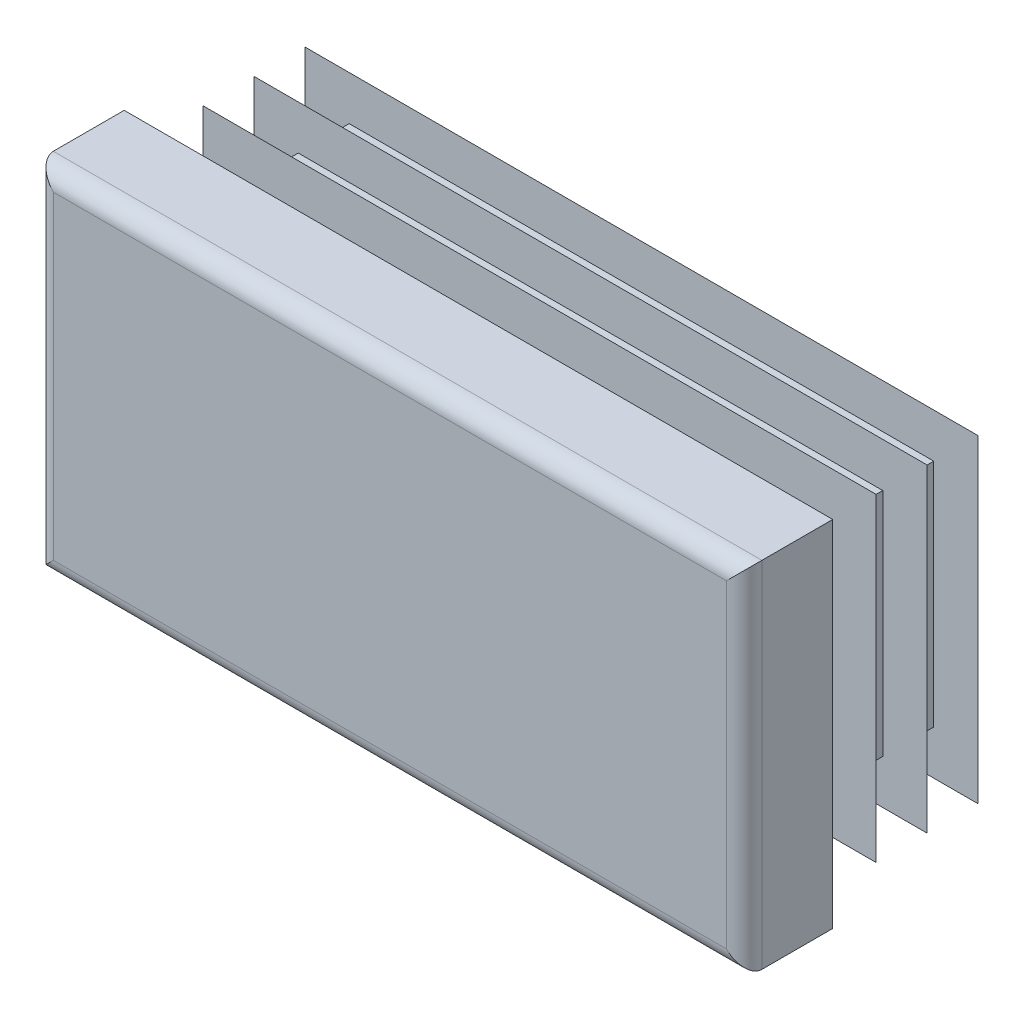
ISO-10303-21;
HEADER;
FILE_DESCRIPTION(('STEP AP214'),'2;1');
FILE_NAME('part.step','',(''),(''),'','','');
FILE_SCHEMA(('AUTOMOTIVE_DESIGN { 1 0 10303 214 1 1 1 1 }'));
ENDSEC;
DATA;
#1=APPLICATION_CONTEXT('core data for automotive mechanical design processes');
#2=APPLICATION_PROTOCOL_DEFINITION('international standard','automotive_design',2000,#1);
#3=PRODUCT_CONTEXT('',#1,'mechanical');
#4=PRODUCT('Part','Part','',(#3));
#5=PRODUCT_RELATED_PRODUCT_CATEGORY('part','',(#4));
#6=PRODUCT_DEFINITION_FORMATION('','',#4);
#7=PRODUCT_DEFINITION_CONTEXT('part definition',#1,'design');
#8=PRODUCT_DEFINITION('design','',#6,#7);
#9=PRODUCT_DEFINITION_SHAPE('','',#8);
#10=(LENGTH_UNIT() NAMED_UNIT(*) SI_UNIT(.MILLI.,.METRE.));
#11=(NAMED_UNIT(*) PLANE_ANGLE_UNIT() SI_UNIT($,.RADIAN.));
#12=(NAMED_UNIT(*) SI_UNIT($,.STERADIAN.) SOLID_ANGLE_UNIT());
#13=UNCERTAINTY_MEASURE_WITH_UNIT(LENGTH_MEASURE(1.E-05),#10,'distance_accuracy_value','');
#14=(GEOMETRIC_REPRESENTATION_CONTEXT(3) GLOBAL_UNCERTAINTY_ASSIGNED_CONTEXT((#13)) GLOBAL_UNIT_ASSIGNED_CONTEXT((#10,
#11,#12)) REPRESENTATION_CONTEXT('',''));
#15=CARTESIAN_POINT('',(0.,0.,0.));
#16=DIRECTION('',(0.,0.,1.));
#17=DIRECTION('',(1.,0.,0.));
#18=AXIS2_PLACEMENT_3D('',#15,#16,#17);
#19=CARTESIAN_POINT('',(19.,-10.,5.));
#20=DIRECTION('',(0.,0.,-1.));
#21=DIRECTION('',(0.,1.,0.));
#22=AXIS2_PLACEMENT_3D('',#19,#20,#21);
#23=PLANE('',#22);
#24=DIRECTION('',(0.,1.,0.));
#25=VECTOR('',#24,1.);
#26=CARTESIAN_POINT('',(-19.,-10.,5.));
#27=LINE('',#26,#25);
#28=CARTESIAN_POINT('',(-19.,-9.,5.));
#29=VERTEX_POINT('',#28);
#30=CARTESIAN_POINT('',(-19.,9.,5.));
#31=VERTEX_POINT('',#30);
#32=EDGE_CURVE('E310',#29,#31,#27,.T.);
#33=ORIENTED_EDGE('',*,*,#32,.F.);
#34=DIRECTION('',(-1.,0.,0.));
#35=VECTOR('',#34,1.);
#36=CARTESIAN_POINT('',(20.,-9.,5.));
#37=LINE('',#36,#35);
#38=CARTESIAN_POINT('',(19.,-9.,5.));
#39=VERTEX_POINT('',#38);
#40=EDGE_CURVE('E482',#39,#29,#37,.T.);
#41=ORIENTED_EDGE('',*,*,#40,.F.);
#42=DIRECTION('',(0.,1.,0.));
#43=VECTOR('',#42,1.);
#44=CARTESIAN_POINT('',(19.,-10.,5.));
#45=LINE('',#44,#43);
#46=CARTESIAN_POINT('',(19.,9.,5.));
#47=VERTEX_POINT('',#46);
#48=EDGE_CURVE('E305',#39,#47,#45,.T.);
#49=ORIENTED_EDGE('',*,*,#48,.T.);
#50=DIRECTION('',(-1.,0.,0.));
#51=VECTOR('',#50,1.);
#52=CARTESIAN_POINT('',(20.,9.,5.));
#53=LINE('',#52,#51);
#54=EDGE_CURVE('E630',#47,#31,#53,.T.);
#55=ORIENTED_EDGE('',*,*,#54,.T.);
#56=EDGE_LOOP('',(#33,#41,#49,#55));
#57=FACE_BOUND('',#56,.T.);
#58=ADVANCED_FACE('F14',(#57),#23,.F.);
#59=CARTESIAN_POINT('',(-19.,-10.,4.));
#60=DIRECTION('',(0.,1.,0.));
#61=DIRECTION('',(-1.,0.,0.));
#62=AXIS2_PLACEMENT_3D('',#59,#60,#61);
#63=CYLINDRICAL_SURFACE('',#62,1.);
#64=DIRECTION('',(0.,1.,0.));
#65=VECTOR('',#64,1.);
#66=CARTESIAN_POINT('',(-20.,-10.,4.));
#67=LINE('',#66,#65);
#68=CARTESIAN_POINT('',(-20.,-10.,4.));
#69=VERTEX_POINT('',#68);
#70=CARTESIAN_POINT('',(-20.,10.,4.));
#71=VERTEX_POINT('',#70);
#72=EDGE_CURVE('E402',#69,#71,#67,.T.);
#73=ORIENTED_EDGE('',*,*,#72,.F.);
#74=CARTESIAN_POINT('',(-19.,-9.,4.));
#75=DIRECTION('',(-0.707106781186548,0.707106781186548,0.));
#76=DIRECTION('',(0.707106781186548,0.707106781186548,0.));
#77=AXIS2_PLACEMENT_3D('',#74,#75,#76);
#78=ELLIPSE('',#77,1.41421356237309,1.);
#79=EDGE_CURVE('E59',#69,#29,#78,.T.);
#80=ORIENTED_EDGE('',*,*,#79,.T.);
#81=ORIENTED_EDGE('',*,*,#32,.T.);
#82=CARTESIAN_POINT('',(-19.,9.,4.));
#83=DIRECTION('',(0.707106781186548,0.707106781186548,0.));
#84=DIRECTION('',(-0.707106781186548,0.707106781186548,0.));
#85=AXIS2_PLACEMENT_3D('',#82,#83,#84);
#86=ELLIPSE('',#85,1.41421356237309,1.);
#87=EDGE_CURVE('E306',#31,#71,#86,.F.);
#88=ORIENTED_EDGE('',*,*,#87,.T.);
#89=EDGE_LOOP('',(#73,#80,#81,#88));
#90=FACE_BOUND('',#89,.T.);
#91=ADVANCED_FACE('F16',(#90),#63,.T.);
#92=CARTESIAN_POINT('',(-20.,-10.,4.));
#93=DIRECTION('',(1.,0.,0.));
#94=DIRECTION('',(0.,1.,0.));
#95=AXIS2_PLACEMENT_3D('',#92,#93,#94);
#96=PLANE('',#95);
#97=DIRECTION('',(0.,0.,-1.));
#98=VECTOR('',#97,1.);
#99=CARTESIAN_POINT('',(-20.,10.,4.));
#100=LINE('',#99,#98);
#101=CARTESIAN_POINT('',(-20.,10.,0.));
#102=VERTEX_POINT('',#101);
#103=EDGE_CURVE('E615',#71,#102,#100,.T.);
#104=ORIENTED_EDGE('',*,*,#103,.T.);
#105=DIRECTION('',(0.,1.,0.));
#106=VECTOR('',#105,1.);
#107=CARTESIAN_POINT('',(-20.,-10.,0.));
#108=LINE('',#107,#106);
#109=CARTESIAN_POINT('',(-20.,-10.,0.));
#110=VERTEX_POINT('',#109);
#111=EDGE_CURVE('E400',#110,#102,#108,.T.);
#112=ORIENTED_EDGE('',*,*,#111,.F.);
#113=DIRECTION('',(0.,0.,-1.));
#114=VECTOR('',#113,1.);
#115=CARTESIAN_POINT('',(-20.,-10.,4.));
#116=LINE('',#115,#114);
#117=EDGE_CURVE('E616',#69,#110,#116,.T.);
#118=ORIENTED_EDGE('',*,*,#117,.F.);
#119=ORIENTED_EDGE('',*,*,#72,.T.);
#120=EDGE_LOOP('',(#104,#112,#118,#119));
#121=FACE_BOUND('',#120,.T.);
#122=ADVANCED_FACE('F697',(#121),#96,.F.);
#123=CARTESIAN_POINT('',(-16.5,-10.,0.));
#124=DIRECTION('',(1.,0.,0.));
#125=DIRECTION('',(0.,1.,0.));
#126=AXIS2_PLACEMENT_3D('',#123,#124,#125);
#127=PLANE('',#126);
#128=DIRECTION('',(0.,1.,0.));
#129=VECTOR('',#128,1.);
#130=CARTESIAN_POINT('',(-16.5,-10.,0.));
#131=LINE('',#130,#129);
#132=CARTESIAN_POINT('',(-16.5,-6.5,0.));
#133=VERTEX_POINT('',#132);
#134=CARTESIAN_POINT('',(-16.5,6.5,0.));
#135=VERTEX_POINT('',#134);
#136=EDGE_CURVE('E397',#133,#135,#131,.T.);
#137=ORIENTED_EDGE('',*,*,#136,.T.);
#138=DIRECTION('',(0.,0.,-1.));
#139=VECTOR('',#138,1.);
#140=CARTESIAN_POINT('',(-16.5,6.5,0.));
#141=LINE('',#140,#139);
#142=CARTESIAN_POINT('',(-16.5,6.5,-0.575));
#143=VERTEX_POINT('',#142);
#144=EDGE_CURVE('E495',#135,#143,#141,.T.);
#145=ORIENTED_EDGE('',*,*,#144,.T.);
#146=DIRECTION('',(0.,1.,0.));
#147=VECTOR('',#146,1.);
#148=CARTESIAN_POINT('',(-16.5,-10.,-0.575));
#149=LINE('',#148,#147);
#150=CARTESIAN_POINT('',(-16.5,-6.5,-0.575));
#151=VERTEX_POINT('',#150);
#152=EDGE_CURVE('E394',#151,#143,#149,.T.);
#153=ORIENTED_EDGE('',*,*,#152,.F.);
#154=DIRECTION('',(0.,0.,1.));
#155=VECTOR('',#154,1.);
#156=CARTESIAN_POINT('',(-16.5,-6.5,0.));
#157=LINE('',#156,#155);
#158=EDGE_CURVE('E489',#151,#133,#157,.T.);
#159=ORIENTED_EDGE('',*,*,#158,.T.);
#160=EDGE_LOOP('',(#137,#145,#153,#159));
#161=FACE_BOUND('',#160,.T.);
#162=ADVANCED_FACE('F787',(#161),#127,.F.);
#163=CARTESIAN_POINT('',(-19.,-10.,-0.575));
#164=DIRECTION('',(0.342020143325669,0.,0.939692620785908));
#165=DIRECTION('',(-0.939692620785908,0.,0.342020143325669));
#166=AXIS2_PLACEMENT_3D('',#163,#164,#165);
#167=PLANE('',#166);
#168=DIRECTION('',(0.,1.,0.));
#169=VECTOR('',#168,1.);
#170=CARTESIAN_POINT('',(-19.,-10.,-0.575));
#171=LINE('',#170,#169);
#172=CARTESIAN_POINT('',(-19.,-9.,-0.575));
#173=VERTEX_POINT('',#172);
#174=CARTESIAN_POINT('',(-19.,9.,-0.575));
#175=VERTEX_POINT('',#174);
#176=EDGE_CURVE('E392',#173,#175,#171,.T.);
#177=ORIENTED_EDGE('',*,*,#176,.T.);
#178=DIRECTION('',(0.844349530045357,-0.438895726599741,-0.307318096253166));
#179=VECTOR('',#178,1.);
#180=CARTESIAN_POINT('',(-11.9589533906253,5.34004028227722,-3.13773138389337));
#181=LINE('',#180,#179);
#182=CARTESIAN_POINT('',(-16.5,7.70049158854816,-1.48492558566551));
#183=VERTEX_POINT('',#182);
#184=EDGE_CURVE('E519',#175,#183,#181,.T.);
#185=ORIENTED_EDGE('',*,*,#184,.T.);
#186=DIRECTION('',(0.,1.,0.));
#187=VECTOR('',#186,1.);
#188=CARTESIAN_POINT('',(-16.5,-10.,-1.48492558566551));
#189=LINE('',#188,#187);
#190=CARTESIAN_POINT('',(-16.5,-7.70049158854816,-1.48492558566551));
#191=VERTEX_POINT('',#190);
#192=EDGE_CURVE('E389',#191,#183,#189,.T.);
#193=ORIENTED_EDGE('',*,*,#192,.F.);
#194=DIRECTION('',(-0.844349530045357,-0.438895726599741,0.307318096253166));
#195=VECTOR('',#194,1.);
#196=CARTESIAN_POINT('',(-19.3705814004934,-9.19262945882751,-0.440119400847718));
#197=LINE('',#196,#195);
#198=EDGE_CURVE('E507',#191,#173,#197,.T.);
#199=ORIENTED_EDGE('',*,*,#198,.T.);
#200=EDGE_LOOP('',(#177,#185,#193,#199));
#201=FACE_BOUND('',#200,.T.);
#202=ADVANCED_FACE('F783',(#201),#167,.F.);
#203=CARTESIAN_POINT('',(-16.5,-10.,-1.48492558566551));
#204=DIRECTION('',(1.,0.,0.));
#205=DIRECTION('',(0.,1.,0.));
#206=AXIS2_PLACEMENT_3D('',#203,#204,#205);
#207=PLANE('',#206);
#208=ORIENTED_EDGE('',*,*,#192,.T.);
#209=DIRECTION('',(0.,-0.819152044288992,-0.573576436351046));
#210=VECTOR('',#209,1.);
#211=CARTESIAN_POINT('',(-16.5,-4.17671654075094,-9.80143625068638));
#212=LINE('',#211,#210);
#213=CARTESIAN_POINT('',(-16.5,6.5,-2.32551884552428));
#214=VERTEX_POINT('',#213);
#215=EDGE_CURVE('E516',#183,#214,#212,.T.);
#216=ORIENTED_EDGE('',*,*,#215,.T.);
#217=DIRECTION('',(0.,0.,-1.));
#218=VECTOR('',#217,1.);
#219=CARTESIAN_POINT('',(-16.5,6.5,-1.48492558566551));
#220=LINE('',#219,#218);
#221=CARTESIAN_POINT('',(-16.5,6.5,-3.45));
#222=VERTEX_POINT('',#221);
#223=EDGE_CURVE('E525',#214,#222,#220,.T.);
#224=ORIENTED_EDGE('',*,*,#223,.T.);
#225=DIRECTION('',(0.,1.,0.));
#226=VECTOR('',#225,1.);
#227=CARTESIAN_POINT('',(-16.5,-10.,-3.45));
#228=LINE('',#227,#226);
#229=CARTESIAN_POINT('',(-16.5,-6.5,-3.45));
#230=VERTEX_POINT('',#229);
#231=EDGE_CURVE('E386',#230,#222,#228,.T.);
#232=ORIENTED_EDGE('',*,*,#231,.F.);
#233=DIRECTION('',(0.,0.,1.));
#234=VECTOR('',#233,1.);
#235=CARTESIAN_POINT('',(-16.5,-6.5,-1.48492558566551));
#236=LINE('',#235,#234);
#237=CARTESIAN_POINT('',(-16.5,-6.5,-2.32551884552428));
#238=VERTEX_POINT('',#237);
#239=EDGE_CURVE('E522',#230,#238,#236,.T.);
#240=ORIENTED_EDGE('',*,*,#239,.T.);
#241=DIRECTION('',(0.,-0.819152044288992,0.573576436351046));
#242=VECTOR('',#241,1.);
#243=CARTESIAN_POINT('',(-16.5,-9.24348489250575,-0.404510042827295));
#244=LINE('',#243,#242);
#245=EDGE_CURVE('E504',#238,#191,#244,.T.);
#246=ORIENTED_EDGE('',*,*,#245,.T.);
#247=EDGE_LOOP('',(#208,#216,#224,#232,#240,#246));
#248=FACE_BOUND('',#247,.T.);
#249=ADVANCED_FACE('F779',(#248),#207,.F.);
#250=CARTESIAN_POINT('',(-19.,-10.,-3.45));
#251=DIRECTION('',(0.342020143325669,0.,0.939692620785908));
#252=DIRECTION('',(-0.939692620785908,0.,0.342020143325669));
#253=AXIS2_PLACEMENT_3D('',#250,#251,#252);
#254=PLANE('',#253);
#255=DIRECTION('',(0.,1.,0.));
#256=VECTOR('',#255,1.);
#257=CARTESIAN_POINT('',(-19.,-10.,-3.45));
#258=LINE('',#257,#256);
#259=CARTESIAN_POINT('',(-19.,-9.,-3.45));
#260=VERTEX_POINT('',#259);
#261=CARTESIAN_POINT('',(-19.,9.,-3.45));
#262=VERTEX_POINT('',#261);
#263=EDGE_CURVE('E384',#260,#262,#258,.T.);
#264=ORIENTED_EDGE('',*,*,#263,.T.);
#265=DIRECTION('',(0.844349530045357,-0.438895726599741,-0.307318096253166));
#266=VECTOR('',#265,1.);
#267=CARTESIAN_POINT('',(-11.9589533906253,5.34004028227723,-6.01273138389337));
#268=LINE('',#267,#266);
#269=CARTESIAN_POINT('',(-16.5,7.70049158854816,-4.35992558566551));
#270=VERTEX_POINT('',#269);
#271=EDGE_CURVE('E549',#262,#270,#268,.T.);
#272=ORIENTED_EDGE('',*,*,#271,.T.);
#273=DIRECTION('',(0.,1.,0.));
#274=VECTOR('',#273,1.);
#275=CARTESIAN_POINT('',(-16.5,-10.,-4.35992558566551));
#276=LINE('',#275,#274);
#277=CARTESIAN_POINT('',(-16.5,-7.70049158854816,-4.35992558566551));
#278=VERTEX_POINT('',#277);
#279=EDGE_CURVE('E381',#278,#270,#276,.T.);
#280=ORIENTED_EDGE('',*,*,#279,.F.);
#281=DIRECTION('',(-0.844349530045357,-0.43889572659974,0.307318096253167));
#282=VECTOR('',#281,1.);
#283=CARTESIAN_POINT('',(-19.3705814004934,-9.19262945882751,-3.31511940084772));
#284=LINE('',#283,#282);
#285=EDGE_CURVE('E537',#278,#260,#284,.T.);
#286=ORIENTED_EDGE('',*,*,#285,.T.);
#287=EDGE_LOOP('',(#264,#272,#280,#286));
#288=FACE_BOUND('',#287,.T.);
#289=ADVANCED_FACE('F775',(#288),#254,.F.);
#290=CARTESIAN_POINT('',(-16.5,-10.,-4.35992558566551));
#291=DIRECTION('',(1.,0.,0.));
#292=DIRECTION('',(0.,1.,0.));
#293=AXIS2_PLACEMENT_3D('',#290,#291,#292);
#294=PLANE('',#293);
#295=ORIENTED_EDGE('',*,*,#279,.T.);
#296=DIRECTION('',(0.,-0.819152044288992,-0.573576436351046));
#297=VECTOR('',#296,1.);
#298=CARTESIAN_POINT('',(-16.5,-4.17671654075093,-12.6764362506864));
#299=LINE('',#298,#297);
#300=CARTESIAN_POINT('',(-16.5,6.5,-5.20051884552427));
#301=VERTEX_POINT('',#300);
#302=EDGE_CURVE('E546',#270,#301,#299,.T.);
#303=ORIENTED_EDGE('',*,*,#302,.T.);
#304=DIRECTION('',(0.,0.,-1.));
#305=VECTOR('',#304,1.);
#306=CARTESIAN_POINT('',(-16.5,6.5,-4.35992558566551));
#307=LINE('',#306,#305);
#308=CARTESIAN_POINT('',(-16.5,6.5,-6.325));
#309=VERTEX_POINT('',#308);
#310=EDGE_CURVE('E555',#301,#309,#307,.T.);
#311=ORIENTED_EDGE('',*,*,#310,.T.);
#312=DIRECTION('',(0.,1.,0.));
#313=VECTOR('',#312,1.);
#314=CARTESIAN_POINT('',(-16.5,-10.,-6.325));
#315=LINE('',#314,#313);
#316=CARTESIAN_POINT('',(-16.5,-6.5,-6.325));
#317=VERTEX_POINT('',#316);
#318=EDGE_CURVE('E378',#317,#309,#315,.T.);
#319=ORIENTED_EDGE('',*,*,#318,.F.);
#320=DIRECTION('',(0.,0.,1.));
#321=VECTOR('',#320,1.);
#322=CARTESIAN_POINT('',(-16.5,-6.5,-4.35992558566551));
#323=LINE('',#322,#321);
#324=CARTESIAN_POINT('',(-16.5,-6.5,-5.20051884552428));
#325=VERTEX_POINT('',#324);
#326=EDGE_CURVE('E552',#317,#325,#323,.T.);
#327=ORIENTED_EDGE('',*,*,#326,.T.);
#328=DIRECTION('',(0.,-0.819152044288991,0.573576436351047));
#329=VECTOR('',#328,1.);
#330=CARTESIAN_POINT('',(-16.5,-9.24348489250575,-3.27951004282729));
#331=LINE('',#330,#329);
#332=EDGE_CURVE('E534',#325,#278,#331,.T.);
#333=ORIENTED_EDGE('',*,*,#332,.T.);
#334=EDGE_LOOP('',(#295,#303,#311,#319,#327,#333));
#335=FACE_BOUND('',#334,.T.);
#336=ADVANCED_FACE('F771',(#335),#294,.F.);
#337=CARTESIAN_POINT('',(-19.,-10.,-6.325));
#338=DIRECTION('',(0.34202014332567,0.,0.939692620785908));
#339=DIRECTION('',(-0.939692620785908,0.,0.34202014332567));
#340=AXIS2_PLACEMENT_3D('',#337,#338,#339);
#341=PLANE('',#340);
#342=DIRECTION('',(0.,1.,0.));
#343=VECTOR('',#342,1.);
#344=CARTESIAN_POINT('',(-19.,-10.,-6.325));
#345=LINE('',#344,#343);
#346=CARTESIAN_POINT('',(-19.,-9.,-6.325));
#347=VERTEX_POINT('',#346);
#348=CARTESIAN_POINT('',(-19.,9.,-6.325));
#349=VERTEX_POINT('',#348);
#350=EDGE_CURVE('E376',#347,#349,#345,.T.);
#351=ORIENTED_EDGE('',*,*,#350,.T.);
#352=DIRECTION('',(0.844349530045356,-0.438895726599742,-0.307318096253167));
#353=VECTOR('',#352,1.);
#354=CARTESIAN_POINT('',(-11.9589533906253,5.34004028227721,-8.88773138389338));
#355=LINE('',#354,#353);
#356=CARTESIAN_POINT('',(-16.5,7.70049158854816,-7.23492558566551));
#357=VERTEX_POINT('',#356);
#358=EDGE_CURVE('E579',#349,#357,#355,.T.);
#359=ORIENTED_EDGE('',*,*,#358,.T.);
#360=DIRECTION('',(0.,1.,0.));
#361=VECTOR('',#360,1.);
#362=CARTESIAN_POINT('',(-16.5,-10.,-7.23492558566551));
#363=LINE('',#362,#361);
#364=CARTESIAN_POINT('',(-16.5,-7.70049158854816,-7.23492558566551));
#365=VERTEX_POINT('',#364);
#366=EDGE_CURVE('E373',#365,#357,#363,.T.);
#367=ORIENTED_EDGE('',*,*,#366,.F.);
#368=DIRECTION('',(-0.844349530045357,-0.438895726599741,0.307318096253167));
#369=VECTOR('',#368,1.);
#370=CARTESIAN_POINT('',(-19.3705814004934,-9.19262945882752,-6.19011940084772));
#371=LINE('',#370,#369);
#372=EDGE_CURVE('E567',#365,#347,#371,.T.);
#373=ORIENTED_EDGE('',*,*,#372,.T.);
#374=EDGE_LOOP('',(#351,#359,#367,#373));
#375=FACE_BOUND('',#374,.T.);
#376=ADVANCED_FACE('F767',(#375),#341,.F.);
#377=CARTESIAN_POINT('',(-16.5,-10.,-7.23492558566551));
#378=DIRECTION('',(1.,0.,0.));
#379=DIRECTION('',(0.,1.,0.));
#380=AXIS2_PLACEMENT_3D('',#377,#378,#379);
#381=PLANE('',#380);
#382=ORIENTED_EDGE('',*,*,#366,.T.);
#383=DIRECTION('',(0.,-0.819152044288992,-0.573576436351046));
#384=VECTOR('',#383,1.);
#385=CARTESIAN_POINT('',(-16.5,-4.17671654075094,-15.5514362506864));
#386=LINE('',#385,#384);
#387=CARTESIAN_POINT('',(-16.5,6.5,-8.07551884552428));
#388=VERTEX_POINT('',#387);
#389=EDGE_CURVE('E576',#357,#388,#386,.T.);
#390=ORIENTED_EDGE('',*,*,#389,.T.);
#391=DIRECTION('',(0.,0.,-1.));
#392=VECTOR('',#391,1.);
#393=CARTESIAN_POINT('',(-16.5,6.5,-7.23492558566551));
#394=LINE('',#393,#392);
#395=CARTESIAN_POINT('',(-16.5,6.5,-9.2));
#396=VERTEX_POINT('',#395);
#397=EDGE_CURVE('E585',#388,#396,#394,.T.);
#398=ORIENTED_EDGE('',*,*,#397,.T.);
#399=DIRECTION('',(0.,1.,0.));
#400=VECTOR('',#399,1.);
#401=CARTESIAN_POINT('',(-16.5,-10.,-9.2));
#402=LINE('',#401,#400);
#403=CARTESIAN_POINT('',(-16.5,-6.5,-9.2));
#404=VERTEX_POINT('',#403);
#405=EDGE_CURVE('E370',#404,#396,#402,.T.);
#406=ORIENTED_EDGE('',*,*,#405,.F.);
#407=DIRECTION('',(0.,0.,1.));
#408=VECTOR('',#407,1.);
#409=CARTESIAN_POINT('',(-16.5,-6.5,-7.23492558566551));
#410=LINE('',#409,#408);
#411=CARTESIAN_POINT('',(-16.5,-6.5,-8.07551884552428));
#412=VERTEX_POINT('',#411);
#413=EDGE_CURVE('E582',#404,#412,#410,.T.);
#414=ORIENTED_EDGE('',*,*,#413,.T.);
#415=DIRECTION('',(0.,-0.819152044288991,0.573576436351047));
#416=VECTOR('',#415,1.);
#417=CARTESIAN_POINT('',(-16.5,-9.24348489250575,-6.1545100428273));
#418=LINE('',#417,#416);
#419=EDGE_CURVE('E564',#412,#365,#418,.T.);
#420=ORIENTED_EDGE('',*,*,#419,.T.);
#421=EDGE_LOOP('',(#382,#390,#398,#406,#414,#420));
#422=FACE_BOUND('',#421,.T.);
#423=ADVANCED_FACE('F764',(#422),#381,.F.);
#424=CARTESIAN_POINT('',(-19.,-10.,-9.2));
#425=DIRECTION('',(0.342020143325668,0.,0.939692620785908));
#426=DIRECTION('',(-0.939692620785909,0.,0.342020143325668));
#427=AXIS2_PLACEMENT_3D('',#424,#425,#426);
#428=PLANE('',#427);
#429=DIRECTION('',(0.,1.,0.));
#430=VECTOR('',#429,1.);
#431=CARTESIAN_POINT('',(-19.,-10.,-9.2));
#432=LINE('',#431,#430);
#433=CARTESIAN_POINT('',(-19.,-9.,-9.2));
#434=VERTEX_POINT('',#433);
#435=CARTESIAN_POINT('',(-19.,9.,-9.2));
#436=VERTEX_POINT('',#435);
#437=EDGE_CURVE('E368',#434,#436,#432,.T.);
#438=ORIENTED_EDGE('',*,*,#437,.T.);
#439=DIRECTION('',(0.844349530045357,-0.438895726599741,-0.307318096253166));
#440=VECTOR('',#439,1.);
#441=CARTESIAN_POINT('',(-11.9589533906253,5.34004028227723,-11.7627313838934));
#442=LINE('',#441,#440);
#443=CARTESIAN_POINT('',(-16.5,7.70049158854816,-10.1099255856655));
#444=VERTEX_POINT('',#443);
#445=EDGE_CURVE('E607',#436,#444,#442,.T.);
#446=ORIENTED_EDGE('',*,*,#445,.T.);
#447=DIRECTION('',(0.,1.,0.));
#448=VECTOR('',#447,1.);
#449=CARTESIAN_POINT('',(-16.5,-10.,-10.1099255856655));
#450=LINE('',#449,#448);
#451=CARTESIAN_POINT('',(-16.5,-7.70049158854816,-10.1099255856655));
#452=VERTEX_POINT('',#451);
#453=EDGE_CURVE('E365',#452,#444,#450,.T.);
#454=ORIENTED_EDGE('',*,*,#453,.F.);
#455=DIRECTION('',(-0.844349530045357,-0.43889572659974,0.307318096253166));
#456=VECTOR('',#455,1.);
#457=CARTESIAN_POINT('',(-19.3705814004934,-9.19262945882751,-9.06511940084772));
#458=LINE('',#457,#456);
#459=EDGE_CURVE('E595',#452,#434,#458,.T.);
#460=ORIENTED_EDGE('',*,*,#459,.T.);
#461=EDGE_LOOP('',(#438,#446,#454,#460));
#462=FACE_BOUND('',#461,.T.);
#463=ADVANCED_FACE('F675',(#462),#428,.F.);
#464=CARTESIAN_POINT('',(-16.5,-10.,-10.1099255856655));
#465=DIRECTION('',(1.,0.,0.));
#466=DIRECTION('',(0.,1.,0.));
#467=AXIS2_PLACEMENT_3D('',#464,#465,#466);
#468=PLANE('',#467);
#469=ORIENTED_EDGE('',*,*,#453,.T.);
#470=DIRECTION('',(0.,-0.819152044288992,-0.573576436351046));
#471=VECTOR('',#470,1.);
#472=CARTESIAN_POINT('',(-16.5,-4.17671654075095,-18.4264362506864));
#473=LINE('',#472,#471);
#474=CARTESIAN_POINT('',(-16.5,6.5,-10.9505188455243));
#475=VERTEX_POINT('',#474);
#476=EDGE_CURVE('E604',#444,#475,#473,.T.);
#477=ORIENTED_EDGE('',*,*,#476,.T.);
#478=DIRECTION('',(0.,0.,-1.));
#479=VECTOR('',#478,1.);
#480=CARTESIAN_POINT('',(-16.5,6.5,-10.1099255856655));
#481=LINE('',#480,#479);
#482=CARTESIAN_POINT('',(-16.5,6.5,-11.5));
#483=VERTEX_POINT('',#482);
#484=EDGE_CURVE('E613',#475,#483,#481,.T.);
#485=ORIENTED_EDGE('',*,*,#484,.T.);
#486=DIRECTION('',(0.,1.,0.));
#487=VECTOR('',#486,1.);
#488=CARTESIAN_POINT('',(-16.5,-10.,-11.5));
#489=LINE('',#488,#487);
#490=CARTESIAN_POINT('',(-16.5,-6.5,-11.5));
#491=VERTEX_POINT('',#490);
#492=EDGE_CURVE('E362',#491,#483,#489,.T.);
#493=ORIENTED_EDGE('',*,*,#492,.F.);
#494=DIRECTION('',(0.,0.,1.));
#495=VECTOR('',#494,1.);
#496=CARTESIAN_POINT('',(-16.5,-6.5,-10.1099255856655));
#497=LINE('',#496,#495);
#498=CARTESIAN_POINT('',(-16.5,-6.5,-10.9505188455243));
#499=VERTEX_POINT('',#498);
#500=EDGE_CURVE('E610',#491,#499,#497,.T.);
#501=ORIENTED_EDGE('',*,*,#500,.T.);
#502=DIRECTION('',(0.,-0.819152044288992,0.573576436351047));
#503=VECTOR('',#502,1.);
#504=CARTESIAN_POINT('',(-16.5,-9.24348489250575,-9.02951004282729));
#505=LINE('',#504,#503);
#506=EDGE_CURVE('E592',#499,#452,#505,.T.);
#507=ORIENTED_EDGE('',*,*,#506,.T.);
#508=EDGE_LOOP('',(#469,#477,#485,#493,#501,#507));
#509=FACE_BOUND('',#508,.T.);
#510=ADVANCED_FACE('F677',(#509),#468,.F.);
#511=CARTESIAN_POINT('',(-16.5,-10.,-11.5));
#512=DIRECTION('',(0.,0.,1.));
#513=DIRECTION('',(0.,-1.,0.));
#514=AXIS2_PLACEMENT_3D('',#511,#512,#513);
#515=PLANE('',#514);
#516=ORIENTED_EDGE('',*,*,#492,.T.);
#517=DIRECTION('',(-1.,0.,0.));
#518=VECTOR('',#517,1.);
#519=CARTESIAN_POINT('',(20.,6.5,-11.5));
#520=LINE('',#519,#518);
#521=CARTESIAN_POINT('',(16.5,6.5,-11.5));
#522=VERTEX_POINT('',#521);
#523=EDGE_CURVE('E438',#522,#483,#520,.T.);
#524=ORIENTED_EDGE('',*,*,#523,.F.);
#525=DIRECTION('',(0.,1.,0.));
#526=VECTOR('',#525,1.);
#527=CARTESIAN_POINT('',(16.5,-10.,-11.5));
#528=LINE('',#527,#526);
#529=CARTESIAN_POINT('',(16.5,-6.5,-11.5));
#530=VERTEX_POINT('',#529);
#531=EDGE_CURVE('E359',#530,#522,#528,.T.);
#532=ORIENTED_EDGE('',*,*,#531,.F.);
#533=DIRECTION('',(-1.,0.,0.));
#534=VECTOR('',#533,1.);
#535=CARTESIAN_POINT('',(20.,-6.5,-11.5));
#536=LINE('',#535,#534);
#537=EDGE_CURVE('E436',#530,#491,#536,.T.);
#538=ORIENTED_EDGE('',*,*,#537,.T.);
#539=EDGE_LOOP('',(#516,#524,#532,#538));
#540=FACE_BOUND('',#539,.T.);
#541=ADVANCED_FACE('F435',(#540),#515,.F.);
#542=CARTESIAN_POINT('',(16.5,-10.,-11.5));
#543=DIRECTION('',(-1.,0.,0.));
#544=DIRECTION('',(0.,-1.,0.));
#545=AXIS2_PLACEMENT_3D('',#542,#543,#544);
#546=PLANE('',#545);
#547=DIRECTION('',(0.,0.,1.));
#548=VECTOR('',#547,1.);
#549=CARTESIAN_POINT('',(16.5,6.5,-11.5));
#550=LINE('',#549,#548);
#551=CARTESIAN_POINT('',(16.5,6.5,-10.9505188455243));
#552=VERTEX_POINT('',#551);
#553=EDGE_CURVE('E9',#522,#552,#550,.T.);
#554=ORIENTED_EDGE('',*,*,#553,.T.);
#555=DIRECTION('',(0.,0.819152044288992,0.573576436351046));
#556=VECTOR('',#555,1.);
#557=CARTESIAN_POINT('',(16.5,-4.82983787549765,-18.8837567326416));
#558=LINE('',#557,#556);
#559=CARTESIAN_POINT('',(16.5,7.70049158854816,-10.1099255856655));
#560=VERTEX_POINT('',#559);
#561=EDGE_CURVE('E601',#552,#560,#558,.T.);
#562=ORIENTED_EDGE('',*,*,#561,.T.);
#563=DIRECTION('',(0.,1.,0.));
#564=VECTOR('',#563,1.);
#565=CARTESIAN_POINT('',(16.5,-10.,-10.1099255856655));
#566=LINE('',#565,#564);
#567=CARTESIAN_POINT('',(16.5,-7.70049158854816,-10.1099255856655));
#568=VERTEX_POINT('',#567);
#569=EDGE_CURVE('E356',#568,#560,#566,.T.);
#570=ORIENTED_EDGE('',*,*,#569,.F.);
#571=DIRECTION('',(0.,0.819152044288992,-0.573576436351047));
#572=VECTOR('',#571,1.);
#573=CARTESIAN_POINT('',(16.5,-8.59036355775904,-9.48683052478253));
#574=LINE('',#573,#572);
#575=CARTESIAN_POINT('',(16.5,-6.5,-10.9505188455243));
#576=VERTEX_POINT('',#575);
#577=EDGE_CURVE('E428',#568,#576,#574,.T.);
#578=ORIENTED_EDGE('',*,*,#577,.T.);
#579=DIRECTION('',(0.,0.,-1.));
#580=VECTOR('',#579,1.);
#581=CARTESIAN_POINT('',(16.5,-6.5,-11.5));
#582=LINE('',#581,#580);
#583=EDGE_CURVE('E23',#576,#530,#582,.T.);
#584=ORIENTED_EDGE('',*,*,#583,.T.);
#585=ORIENTED_EDGE('',*,*,#531,.T.);
#586=EDGE_LOOP('',(#554,#562,#570,#578,#584,#585));
#587=FACE_BOUND('',#586,.T.);
#588=ADVANCED_FACE('F426',(#587),#546,.F.);
#589=CARTESIAN_POINT('',(16.5,-10.,-10.1099255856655));
#590=DIRECTION('',(-0.342020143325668,0.,0.939692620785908));
#591=DIRECTION('',(-0.939692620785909,0.,-0.342020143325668));
#592=AXIS2_PLACEMENT_3D('',#589,#590,#591);
#593=PLANE('',#592);
#594=ORIENTED_EDGE('',*,*,#569,.T.);
#595=DIRECTION('',(0.844349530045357,0.438895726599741,0.307318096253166));
#596=VECTOR('',#595,1.);
#597=CARTESIAN_POINT('',(9.94052703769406,4.29085547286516,-12.4973784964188));
#598=LINE('',#597,#596);
#599=CARTESIAN_POINT('',(19.,9.,-9.2));
#600=VERTEX_POINT('',#599);
#601=EDGE_CURVE('E598',#560,#600,#598,.T.);
#602=ORIENTED_EDGE('',*,*,#601,.T.);
#603=DIRECTION('',(0.,1.,0.));
#604=VECTOR('',#603,1.);
#605=CARTESIAN_POINT('',(19.,-10.,-9.2));
#606=LINE('',#605,#604);
#607=CARTESIAN_POINT('',(19.,-9.,-9.2));
#608=VERTEX_POINT('',#607);
#609=EDGE_CURVE('E353',#608,#600,#606,.T.);
#610=ORIENTED_EDGE('',*,*,#609,.F.);
#611=DIRECTION('',(-0.844349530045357,0.43889572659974,-0.307318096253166));
#612=VECTOR('',#611,1.);
#613=CARTESIAN_POINT('',(17.3521550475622,-8.14344464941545,-9.79976651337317));
#614=LINE('',#613,#612);
#615=EDGE_CURVE('E588',#608,#568,#614,.T.);
#616=ORIENTED_EDGE('',*,*,#615,.T.);
#617=EDGE_LOOP('',(#594,#602,#610,#616));
#618=FACE_BOUND('',#617,.T.);
#619=ADVANCED_FACE('F752',(#618),#593,.F.);
#620=CARTESIAN_POINT('',(19.,-10.,-9.2));
#621=DIRECTION('',(0.,0.,-1.));
#622=DIRECTION('',(0.,1.,0.));
#623=AXIS2_PLACEMENT_3D('',#620,#621,#622);
#624=PLANE('',#623);
#625=ORIENTED_EDGE('',*,*,#609,.T.);
#626=DIRECTION('',(-1.,0.,0.));
#627=VECTOR('',#626,1.);
#628=CARTESIAN_POINT('',(20.,9.,-9.2));
#629=LINE('',#628,#627);
#630=EDGE_CURVE('E444',#600,#436,#629,.T.);
#631=ORIENTED_EDGE('',*,*,#630,.T.);
#632=ORIENTED_EDGE('',*,*,#437,.F.);
#633=DIRECTION('',(-1.,0.,0.));
#634=VECTOR('',#633,1.);
#635=CARTESIAN_POINT('',(20.,-9.,-9.2));
#636=LINE('',#635,#634);
#637=EDGE_CURVE('E451',#608,#434,#636,.T.);
#638=ORIENTED_EDGE('',*,*,#637,.F.);
#639=EDGE_LOOP('',(#625,#631,#632,#638));
#640=FACE_BOUND('',#639,.T.);
#641=ORIENTED_EDGE('',*,*,#405,.T.);
#642=DIRECTION('',(-1.,0.,0.));
#643=VECTOR('',#642,1.);
#644=CARTESIAN_POINT('',(20.,6.5,-9.2));
#645=LINE('',#644,#643);
#646=CARTESIAN_POINT('',(16.5,6.5,-9.2));
#647=VERTEX_POINT('',#646);
#648=EDGE_CURVE('E663',#647,#396,#645,.T.);
#649=ORIENTED_EDGE('',*,*,#648,.F.);
#650=DIRECTION('',(0.,1.,0.));
#651=VECTOR('',#650,1.);
#652=CARTESIAN_POINT('',(16.5,-10.,-9.2));
#653=LINE('',#652,#651);
#654=CARTESIAN_POINT('',(16.5,-6.5,-9.2));
#655=VERTEX_POINT('',#654);
#656=EDGE_CURVE('E350',#655,#647,#653,.T.);
#657=ORIENTED_EDGE('',*,*,#656,.F.);
#658=DIRECTION('',(-1.,0.,0.));
#659=VECTOR('',#658,1.);
#660=CARTESIAN_POINT('',(20.,-6.5,-9.2));
#661=LINE('',#660,#659);
#662=EDGE_CURVE('E453',#655,#404,#661,.T.);
#663=ORIENTED_EDGE('',*,*,#662,.T.);
#664=EDGE_LOOP('',(#641,#649,#657,#663));
#665=FACE_BOUND('',#664,.T.);
#666=ADVANCED_FACE('F667',(#640,#665),#624,.F.);
#667=CARTESIAN_POINT('',(16.5,-10.,-9.2));
#668=DIRECTION('',(-1.,0.,0.));
#669=DIRECTION('',(0.,-1.,0.));
#670=AXIS2_PLACEMENT_3D('',#667,#668,#669);
#671=PLANE('',#670);
#672=DIRECTION('',(0.,0.,1.));
#673=VECTOR('',#672,1.);
#674=CARTESIAN_POINT('',(16.5,6.5,-9.2));
#675=LINE('',#674,#673);
#676=CARTESIAN_POINT('',(16.5,6.5,-8.07551884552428));
#677=VERTEX_POINT('',#676);
#678=EDGE_CURVE('E420',#647,#677,#675,.T.);
#679=ORIENTED_EDGE('',*,*,#678,.T.);
#680=DIRECTION('',(0.,0.819152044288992,0.573576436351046));
#681=VECTOR('',#680,1.);
#682=CARTESIAN_POINT('',(16.5,-5.0999995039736,-16.1979259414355));
#683=LINE('',#682,#681);
#684=CARTESIAN_POINT('',(16.5,7.70049158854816,-7.23492558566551));
#685=VERTEX_POINT('',#684);
#686=EDGE_CURVE('E573',#677,#685,#683,.T.);
#687=ORIENTED_EDGE('',*,*,#686,.T.);
#688=DIRECTION('',(0.,1.,0.));
#689=VECTOR('',#688,1.);
#690=CARTESIAN_POINT('',(16.5,-10.,-7.23492558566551));
#691=LINE('',#690,#689);
#692=CARTESIAN_POINT('',(16.5,-7.70049158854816,-7.23492558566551));
#693=VERTEX_POINT('',#692);
#694=EDGE_CURVE('E347',#693,#685,#691,.T.);
#695=ORIENTED_EDGE('',*,*,#694,.F.);
#696=DIRECTION('',(0.,0.819152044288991,-0.573576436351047));
#697=VECTOR('',#696,1.);
#698=CARTESIAN_POINT('',(16.5,-8.32020192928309,-6.8009997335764));
#699=LINE('',#698,#697);
#700=CARTESIAN_POINT('',(16.5,-6.5,-8.07551884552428));
#701=VERTEX_POINT('',#700);
#702=EDGE_CURVE('E561',#693,#701,#699,.T.);
#703=ORIENTED_EDGE('',*,*,#702,.T.);
#704=DIRECTION('',(0.,0.,-1.));
#705=VECTOR('',#704,1.);
#706=CARTESIAN_POINT('',(16.5,-6.5,-9.2));
#707=LINE('',#706,#705);
#708=EDGE_CURVE('E417',#701,#655,#707,.T.);
#709=ORIENTED_EDGE('',*,*,#708,.T.);
#710=ORIENTED_EDGE('',*,*,#656,.T.);
#711=EDGE_LOOP('',(#679,#687,#695,#703,#709,#710));
#712=FACE_BOUND('',#711,.T.);
#713=ADVANCED_FACE('F745',(#712),#671,.F.);
#714=CARTESIAN_POINT('',(16.5,-10.,-7.23492558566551));
#715=DIRECTION('',(-0.342020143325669,0.,0.939692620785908));
#716=DIRECTION('',(-0.939692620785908,0.,-0.342020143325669));
#717=AXIS2_PLACEMENT_3D('',#714,#715,#716);
#718=PLANE('',#717);
#719=ORIENTED_EDGE('',*,*,#694,.T.);
#720=DIRECTION('',(0.844349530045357,0.438895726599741,0.307318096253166));
#721=VECTOR('',#720,1.);
#722=CARTESIAN_POINT('',(9.94052703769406,4.29085547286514,-9.62237849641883));
#723=LINE('',#722,#721);
#724=CARTESIAN_POINT('',(19.,9.,-6.325));
#725=VERTEX_POINT('',#724);
#726=EDGE_CURVE('E570',#685,#725,#723,.T.);
#727=ORIENTED_EDGE('',*,*,#726,.T.);
#728=DIRECTION('',(0.,1.,0.));
#729=VECTOR('',#728,1.);
#730=CARTESIAN_POINT('',(19.,-10.,-6.325));
#731=LINE('',#730,#729);
#732=CARTESIAN_POINT('',(19.,-9.,-6.325));
#733=VERTEX_POINT('',#732);
#734=EDGE_CURVE('E344',#733,#725,#731,.T.);
#735=ORIENTED_EDGE('',*,*,#734,.F.);
#736=DIRECTION('',(-0.844349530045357,0.43889572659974,-0.307318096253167));
#737=VECTOR('',#736,1.);
#738=CARTESIAN_POINT('',(17.3521550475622,-8.14344464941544,-6.92476651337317));
#739=LINE('',#738,#737);
#740=EDGE_CURVE('E558',#733,#693,#739,.T.);
#741=ORIENTED_EDGE('',*,*,#740,.T.);
#742=EDGE_LOOP('',(#719,#727,#735,#741));
#743=FACE_BOUND('',#742,.T.);
#744=ADVANCED_FACE('F741',(#743),#718,.F.);
#745=CARTESIAN_POINT('',(19.,-10.,-6.325));
#746=DIRECTION('',(0.,0.,-1.));
#747=DIRECTION('',(0.,1.,0.));
#748=AXIS2_PLACEMENT_3D('',#745,#746,#747);
#749=PLANE('',#748);
#750=ORIENTED_EDGE('',*,*,#734,.T.);
#751=DIRECTION('',(-1.,0.,0.));
#752=VECTOR('',#751,1.);
#753=CARTESIAN_POINT('',(20.,9.,-6.325));
#754=LINE('',#753,#752);
#755=EDGE_CURVE('E657',#725,#349,#754,.T.);
#756=ORIENTED_EDGE('',*,*,#755,.T.);
#757=ORIENTED_EDGE('',*,*,#350,.F.);
#758=DIRECTION('',(-1.,0.,0.));
#759=VECTOR('',#758,1.);
#760=CARTESIAN_POINT('',(20.,-9.,-6.325));
#761=LINE('',#760,#759);
#762=EDGE_CURVE('E459',#733,#347,#761,.T.);
#763=ORIENTED_EDGE('',*,*,#762,.F.);
#764=EDGE_LOOP('',(#750,#756,#757,#763));
#765=FACE_BOUND('',#764,.T.);
#766=ORIENTED_EDGE('',*,*,#318,.T.);
#767=DIRECTION('',(-1.,0.,0.));
#768=VECTOR('',#767,1.);
#769=CARTESIAN_POINT('',(20.,6.5,-6.325));
#770=LINE('',#769,#768);
#771=CARTESIAN_POINT('',(16.5,6.5,-6.325));
#772=VERTEX_POINT('',#771);
#773=EDGE_CURVE('E655',#772,#309,#770,.T.);
#774=ORIENTED_EDGE('',*,*,#773,.F.);
#775=DIRECTION('',(0.,1.,0.));
#776=VECTOR('',#775,1.);
#777=CARTESIAN_POINT('',(16.5,-10.,-6.325));
#778=LINE('',#777,#776);
#779=CARTESIAN_POINT('',(16.5,-6.5,-6.325));
#780=VERTEX_POINT('',#779);
#781=EDGE_CURVE('E341',#780,#772,#778,.T.);
#782=ORIENTED_EDGE('',*,*,#781,.F.);
#783=DIRECTION('',(-1.,0.,0.));
#784=VECTOR('',#783,1.);
#785=CARTESIAN_POINT('',(20.,-6.5,-6.325));
#786=LINE('',#785,#784);
#787=EDGE_CURVE('E461',#780,#317,#786,.T.);
#788=ORIENTED_EDGE('',*,*,#787,.T.);
#789=EDGE_LOOP('',(#766,#774,#782,#788));
#790=FACE_BOUND('',#789,.T.);
#791=ADVANCED_FACE('F737',(#765,#790),#749,.F.);
#792=CARTESIAN_POINT('',(16.5,-10.,-6.325));
#793=DIRECTION('',(-1.,0.,0.));
#794=DIRECTION('',(0.,-1.,0.));
#795=AXIS2_PLACEMENT_3D('',#792,#793,#794);
#796=PLANE('',#795);
#797=DIRECTION('',(0.,0.,1.));
#798=VECTOR('',#797,1.);
#799=CARTESIAN_POINT('',(16.5,6.5,-6.325));
#800=LINE('',#799,#798);
#801=CARTESIAN_POINT('',(16.5,6.5,-5.20051884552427));
#802=VERTEX_POINT('',#801);
#803=EDGE_CURVE('E414',#772,#802,#800,.T.);
#804=ORIENTED_EDGE('',*,*,#803,.T.);
#805=DIRECTION('',(0.,0.819152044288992,0.573576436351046));
#806=VECTOR('',#805,1.);
#807=CARTESIAN_POINT('',(16.5,-5.09999950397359,-13.3229259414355));
#808=LINE('',#807,#806);
#809=CARTESIAN_POINT('',(16.5,7.70049158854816,-4.35992558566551));
#810=VERTEX_POINT('',#809);
#811=EDGE_CURVE('E543',#802,#810,#808,.T.);
#812=ORIENTED_EDGE('',*,*,#811,.T.);
#813=DIRECTION('',(0.,1.,0.));
#814=VECTOR('',#813,1.);
#815=CARTESIAN_POINT('',(16.5,-10.,-4.35992558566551));
#816=LINE('',#815,#814);
#817=CARTESIAN_POINT('',(16.5,-7.70049158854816,-4.35992558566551));
#818=VERTEX_POINT('',#817);
#819=EDGE_CURVE('E338',#818,#810,#816,.T.);
#820=ORIENTED_EDGE('',*,*,#819,.F.);
#821=DIRECTION('',(0.,0.819152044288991,-0.573576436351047));
#822=VECTOR('',#821,1.);
#823=CARTESIAN_POINT('',(16.5,-8.32020192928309,-3.9259997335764));
#824=LINE('',#823,#822);
#825=CARTESIAN_POINT('',(16.5,-6.5,-5.20051884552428));
#826=VERTEX_POINT('',#825);
#827=EDGE_CURVE('E531',#818,#826,#824,.T.);
#828=ORIENTED_EDGE('',*,*,#827,.T.);
#829=DIRECTION('',(0.,0.,-1.));
#830=VECTOR('',#829,1.);
#831=CARTESIAN_POINT('',(16.5,-6.5,-6.325));
#832=LINE('',#831,#830);
#833=EDGE_CURVE('E411',#826,#780,#832,.T.);
#834=ORIENTED_EDGE('',*,*,#833,.T.);
#835=ORIENTED_EDGE('',*,*,#781,.T.);
#836=EDGE_LOOP('',(#804,#812,#820,#828,#834,#835));
#837=FACE_BOUND('',#836,.T.);
#838=ADVANCED_FACE('F733',(#837),#796,.F.);
#839=CARTESIAN_POINT('',(16.5,-10.,-4.35992558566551));
#840=DIRECTION('',(-0.342020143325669,0.,0.939692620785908));
#841=DIRECTION('',(-0.939692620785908,0.,-0.342020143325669));
#842=AXIS2_PLACEMENT_3D('',#839,#840,#841);
#843=PLANE('',#842);
#844=ORIENTED_EDGE('',*,*,#819,.T.);
#845=DIRECTION('',(0.844349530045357,0.438895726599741,0.307318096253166));
#846=VECTOR('',#845,1.);
#847=CARTESIAN_POINT('',(9.94052703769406,4.29085547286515,-6.74737849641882));
#848=LINE('',#847,#846);
#849=CARTESIAN_POINT('',(19.,9.,-3.45));
#850=VERTEX_POINT('',#849);
#851=EDGE_CURVE('E540',#810,#850,#848,.T.);
#852=ORIENTED_EDGE('',*,*,#851,.T.);
#853=DIRECTION('',(0.,1.,0.));
#854=VECTOR('',#853,1.);
#855=CARTESIAN_POINT('',(19.,-10.,-3.45));
#856=LINE('',#855,#854);
#857=CARTESIAN_POINT('',(19.,-9.,-3.45));
#858=VERTEX_POINT('',#857);
#859=EDGE_CURVE('E335',#858,#850,#856,.T.);
#860=ORIENTED_EDGE('',*,*,#859,.F.);
#861=DIRECTION('',(-0.844349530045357,0.43889572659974,-0.307318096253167));
#862=VECTOR('',#861,1.);
#863=CARTESIAN_POINT('',(17.3521550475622,-8.14344464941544,-4.04976651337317));
#864=LINE('',#863,#862);
#865=EDGE_CURVE('E528',#858,#818,#864,.T.);
#866=ORIENTED_EDGE('',*,*,#865,.T.);
#867=EDGE_LOOP('',(#844,#852,#860,#866));
#868=FACE_BOUND('',#867,.T.);
#869=ADVANCED_FACE('F729',(#868),#843,.F.);
#870=CARTESIAN_POINT('',(19.,-10.,-3.45));
#871=DIRECTION('',(0.,0.,-1.));
#872=DIRECTION('',(0.,1.,0.));
#873=AXIS2_PLACEMENT_3D('',#870,#871,#872);
#874=PLANE('',#873);
#875=ORIENTED_EDGE('',*,*,#859,.T.);
#876=DIRECTION('',(-1.,0.,0.));
#877=VECTOR('',#876,1.);
#878=CARTESIAN_POINT('',(20.,9.,-3.45));
#879=LINE('',#878,#877);
#880=EDGE_CURVE('E649',#850,#262,#879,.T.);
#881=ORIENTED_EDGE('',*,*,#880,.T.);
#882=ORIENTED_EDGE('',*,*,#263,.F.);
#883=DIRECTION('',(-1.,0.,0.));
#884=VECTOR('',#883,1.);
#885=CARTESIAN_POINT('',(20.,-9.,-3.45));
#886=LINE('',#885,#884);
#887=EDGE_CURVE('E467',#858,#260,#886,.T.);
#888=ORIENTED_EDGE('',*,*,#887,.F.);
#889=EDGE_LOOP('',(#875,#881,#882,#888));
#890=FACE_BOUND('',#889,.T.);
#891=ORIENTED_EDGE('',*,*,#231,.T.);
#892=DIRECTION('',(-1.,0.,0.));
#893=VECTOR('',#892,1.);
#894=CARTESIAN_POINT('',(20.,6.5,-3.45));
#895=LINE('',#894,#893);
#896=CARTESIAN_POINT('',(16.5,6.5,-3.45));
#897=VERTEX_POINT('',#896);
#898=EDGE_CURVE('E647',#897,#222,#895,.T.);
#899=ORIENTED_EDGE('',*,*,#898,.F.);
#900=DIRECTION('',(0.,1.,0.));
#901=VECTOR('',#900,1.);
#902=CARTESIAN_POINT('',(16.5,-10.,-3.45));
#903=LINE('',#902,#901);
#904=CARTESIAN_POINT('',(16.5,-6.5,-3.45));
#905=VERTEX_POINT('',#904);
#906=EDGE_CURVE('E332',#905,#897,#903,.T.);
#907=ORIENTED_EDGE('',*,*,#906,.F.);
#908=DIRECTION('',(-1.,0.,0.));
#909=VECTOR('',#908,1.);
#910=CARTESIAN_POINT('',(20.,-6.5,-3.45));
#911=LINE('',#910,#909);
#912=EDGE_CURVE('E469',#905,#230,#911,.T.);
#913=ORIENTED_EDGE('',*,*,#912,.T.);
#914=EDGE_LOOP('',(#891,#899,#907,#913));
#915=FACE_BOUND('',#914,.T.);
#916=ADVANCED_FACE('F725',(#890,#915),#874,.F.);
#917=CARTESIAN_POINT('',(16.5,-10.,-3.45));
#918=DIRECTION('',(-1.,0.,0.));
#919=DIRECTION('',(0.,-1.,0.));
#920=AXIS2_PLACEMENT_3D('',#917,#918,#919);
#921=PLANE('',#920);
#922=DIRECTION('',(0.,0.,1.));
#923=VECTOR('',#922,1.);
#924=CARTESIAN_POINT('',(16.5,6.5,-3.45));
#925=LINE('',#924,#923);
#926=CARTESIAN_POINT('',(16.5,6.5,-2.32551884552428));
#927=VERTEX_POINT('',#926);
#928=EDGE_CURVE('E408',#897,#927,#925,.T.);
#929=ORIENTED_EDGE('',*,*,#928,.T.);
#930=DIRECTION('',(0.,0.819152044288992,0.573576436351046));
#931=VECTOR('',#930,1.);
#932=CARTESIAN_POINT('',(16.5,-5.0999995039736,-10.4479259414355));
#933=LINE('',#932,#931);
#934=CARTESIAN_POINT('',(16.5,7.70049158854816,-1.48492558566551));
#935=VERTEX_POINT('',#934);
#936=EDGE_CURVE('E513',#927,#935,#933,.T.);
#937=ORIENTED_EDGE('',*,*,#936,.T.);
#938=DIRECTION('',(0.,1.,0.));
#939=VECTOR('',#938,1.);
#940=CARTESIAN_POINT('',(16.5,-10.,-1.48492558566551));
#941=LINE('',#940,#939);
#942=CARTESIAN_POINT('',(16.5,-7.70049158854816,-1.48492558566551));
#943=VERTEX_POINT('',#942);
#944=EDGE_CURVE('E329',#943,#935,#941,.T.);
#945=ORIENTED_EDGE('',*,*,#944,.F.);
#946=DIRECTION('',(0.,0.819152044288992,-0.573576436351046));
#947=VECTOR('',#946,1.);
#948=CARTESIAN_POINT('',(16.5,-8.32020192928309,-1.0509997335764));
#949=LINE('',#948,#947);
#950=CARTESIAN_POINT('',(16.5,-6.5,-2.32551884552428));
#951=VERTEX_POINT('',#950);
#952=EDGE_CURVE('E501',#943,#951,#949,.T.);
#953=ORIENTED_EDGE('',*,*,#952,.T.);
#954=DIRECTION('',(0.,0.,-1.));
#955=VECTOR('',#954,1.);
#956=CARTESIAN_POINT('',(16.5,-6.5,-3.45));
#957=LINE('',#956,#955);
#958=EDGE_CURVE('E405',#951,#905,#957,.T.);
#959=ORIENTED_EDGE('',*,*,#958,.T.);
#960=ORIENTED_EDGE('',*,*,#906,.T.);
#961=EDGE_LOOP('',(#929,#937,#945,#953,#959,#960));
#962=FACE_BOUND('',#961,.T.);
#963=ADVANCED_FACE('F721',(#962),#921,.F.);
#964=CARTESIAN_POINT('',(16.5,-10.,-1.48492558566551));
#965=DIRECTION('',(-0.342020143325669,0.,0.939692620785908));
#966=DIRECTION('',(-0.939692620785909,0.,-0.342020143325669));
#967=AXIS2_PLACEMENT_3D('',#964,#965,#966);
#968=PLANE('',#967);
#969=ORIENTED_EDGE('',*,*,#944,.T.);
#970=DIRECTION('',(0.844349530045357,0.438895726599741,0.307318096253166));
#971=VECTOR('',#970,1.);
#972=CARTESIAN_POINT('',(9.94052703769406,4.29085547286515,-3.87237849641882));
#973=LINE('',#972,#971);
#974=CARTESIAN_POINT('',(19.,9.,-0.575));
#975=VERTEX_POINT('',#974);
#976=EDGE_CURVE('E510',#935,#975,#973,.T.);
#977=ORIENTED_EDGE('',*,*,#976,.T.);
#978=DIRECTION('',(0.,1.,0.));
#979=VECTOR('',#978,1.);
#980=CARTESIAN_POINT('',(19.,-10.,-0.575));
#981=LINE('',#980,#979);
#982=CARTESIAN_POINT('',(19.,-9.,-0.575));
#983=VERTEX_POINT('',#982);
#984=EDGE_CURVE('E326',#983,#975,#981,.T.);
#985=ORIENTED_EDGE('',*,*,#984,.F.);
#986=DIRECTION('',(-0.844349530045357,0.438895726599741,-0.307318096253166));
#987=VECTOR('',#986,1.);
#988=CARTESIAN_POINT('',(17.3521550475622,-8.14344464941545,-1.17476651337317));
#989=LINE('',#988,#987);
#990=EDGE_CURVE('E498',#983,#943,#989,.T.);
#991=ORIENTED_EDGE('',*,*,#990,.T.);
#992=EDGE_LOOP('',(#969,#977,#985,#991));
#993=FACE_BOUND('',#992,.T.);
#994=ADVANCED_FACE('F717',(#993),#968,.F.);
#995=CARTESIAN_POINT('',(19.,-10.,-0.575));
#996=DIRECTION('',(0.,0.,-1.));
#997=DIRECTION('',(0.,1.,0.));
#998=AXIS2_PLACEMENT_3D('',#995,#996,#997);
#999=PLANE('',#998);
#1000=ORIENTED_EDGE('',*,*,#984,.T.);
#1001=DIRECTION('',(-1.,0.,0.));
#1002=VECTOR('',#1001,1.);
#1003=CARTESIAN_POINT('',(20.,9.,-0.575));
#1004=LINE('',#1003,#1002);
#1005=EDGE_CURVE('E641',#975,#175,#1004,.T.);
#1006=ORIENTED_EDGE('',*,*,#1005,.T.);
#1007=ORIENTED_EDGE('',*,*,#176,.F.);
#1008=DIRECTION('',(-1.,0.,0.));
#1009=VECTOR('',#1008,1.);
#1010=CARTESIAN_POINT('',(20.,-9.,-0.575));
#1011=LINE('',#1010,#1009);
#1012=EDGE_CURVE('E475',#983,#173,#1011,.T.);
#1013=ORIENTED_EDGE('',*,*,#1012,.F.);
#1014=EDGE_LOOP('',(#1000,#1006,#1007,#1013));
#1015=FACE_BOUND('',#1014,.T.);
#1016=ORIENTED_EDGE('',*,*,#152,.T.);
#1017=DIRECTION('',(-1.,0.,0.));
#1018=VECTOR('',#1017,1.);
#1019=CARTESIAN_POINT('',(20.,6.5,-0.575));
#1020=LINE('',#1019,#1018);
#1021=CARTESIAN_POINT('',(16.5,6.5,-0.575));
#1022=VERTEX_POINT('',#1021);
#1023=EDGE_CURVE('E639',#1022,#143,#1020,.T.);
#1024=ORIENTED_EDGE('',*,*,#1023,.F.);
#1025=DIRECTION('',(0.,1.,0.));
#1026=VECTOR('',#1025,1.);
#1027=CARTESIAN_POINT('',(16.5,-10.,-0.575));
#1028=LINE('',#1027,#1026);
#1029=CARTESIAN_POINT('',(16.5,-6.5,-0.575));
#1030=VERTEX_POINT('',#1029);
#1031=EDGE_CURVE('E323',#1030,#1022,#1028,.T.);
#1032=ORIENTED_EDGE('',*,*,#1031,.F.);
#1033=DIRECTION('',(-1.,0.,0.));
#1034=VECTOR('',#1033,1.);
#1035=CARTESIAN_POINT('',(20.,-6.5,-0.575));
#1036=LINE('',#1035,#1034);
#1037=EDGE_CURVE('E477',#1030,#151,#1036,.T.);
#1038=ORIENTED_EDGE('',*,*,#1037,.T.);
#1039=EDGE_LOOP('',(#1016,#1024,#1032,#1038));
#1040=FACE_BOUND('',#1039,.T.);
#1041=ADVANCED_FACE('F713',(#1015,#1040),#999,.F.);
#1042=CARTESIAN_POINT('',(16.5,-10.,-0.575));
#1043=DIRECTION('',(-1.,0.,0.));
#1044=DIRECTION('',(0.,-1.,0.));
#1045=AXIS2_PLACEMENT_3D('',#1042,#1043,#1044);
#1046=PLANE('',#1045);
#1047=ORIENTED_EDGE('',*,*,#1031,.T.);
#1048=DIRECTION('',(0.,0.,1.));
#1049=VECTOR('',#1048,1.);
#1050=CARTESIAN_POINT('',(16.5,6.5,-0.575));
#1051=LINE('',#1050,#1049);
#1052=CARTESIAN_POINT('',(16.5,6.5,0.));
#1053=VERTEX_POINT('',#1052);
#1054=EDGE_CURVE('E492',#1022,#1053,#1051,.T.);
#1055=ORIENTED_EDGE('',*,*,#1054,.T.);
#1056=DIRECTION('',(0.,1.,0.));
#1057=VECTOR('',#1056,1.);
#1058=CARTESIAN_POINT('',(16.5,-10.,0.));
#1059=LINE('',#1058,#1057);
#1060=CARTESIAN_POINT('',(16.5,-6.5,0.));
#1061=VERTEX_POINT('',#1060);
#1062=EDGE_CURVE('E316',#1061,#1053,#1059,.T.);
#1063=ORIENTED_EDGE('',*,*,#1062,.F.);
#1064=DIRECTION('',(0.,0.,-1.));
#1065=VECTOR('',#1064,1.);
#1066=CARTESIAN_POINT('',(16.5,-6.5,-0.575));
#1067=LINE('',#1066,#1065);
#1068=EDGE_CURVE('E486',#1061,#1030,#1067,.T.);
#1069=ORIENTED_EDGE('',*,*,#1068,.T.);
#1070=EDGE_LOOP('',(#1047,#1055,#1063,#1069));
#1071=FACE_BOUND('',#1070,.T.);
#1072=ADVANCED_FACE('F709',(#1071),#1046,.F.);
#1073=CARTESIAN_POINT('',(16.5,-10.,0.));
#1074=DIRECTION('',(0.,0.,1.));
#1075=DIRECTION('',(0.,-1.,0.));
#1076=AXIS2_PLACEMENT_3D('',#1073,#1074,#1075);
#1077=PLANE('',#1076);
#1078=DIRECTION('',(-1.,0.,0.));
#1079=VECTOR('',#1078,1.);
#1080=CARTESIAN_POINT('',(20.,6.5,0.));
#1081=LINE('',#1080,#1079);
#1082=EDGE_CURVE('E634',#1053,#135,#1081,.T.);
#1083=ORIENTED_EDGE('',*,*,#1082,.T.);
#1084=ORIENTED_EDGE('',*,*,#136,.F.);
#1085=DIRECTION('',(-1.,0.,0.));
#1086=VECTOR('',#1085,1.);
#1087=CARTESIAN_POINT('',(20.,-6.5,0.));
#1088=LINE('',#1087,#1086);
#1089=EDGE_CURVE('E296',#1061,#133,#1088,.T.);
#1090=ORIENTED_EDGE('',*,*,#1089,.F.);
#1091=ORIENTED_EDGE('',*,*,#1062,.T.);
#1092=EDGE_LOOP('',(#1083,#1084,#1090,#1091));
#1093=FACE_BOUND('',#1092,.T.);
#1094=ORIENTED_EDGE('',*,*,#111,.T.);
#1095=DIRECTION('',(1.,0.,0.));
#1096=VECTOR('',#1095,1.);
#1097=CARTESIAN_POINT('',(16.5,10.,0.));
#1098=LINE('',#1097,#1096);
#1099=CARTESIAN_POINT('',(20.,10.,0.));
#1100=VERTEX_POINT('',#1099);
#1101=EDGE_CURVE('E621',#102,#1100,#1098,.T.);
#1102=ORIENTED_EDGE('',*,*,#1101,.T.);
#1103=DIRECTION('',(0.,1.,0.));
#1104=VECTOR('',#1103,1.);
#1105=CARTESIAN_POINT('',(20.,-10.,0.));
#1106=LINE('',#1105,#1104);
#1107=CARTESIAN_POINT('',(20.,-10.,0.));
#1108=VERTEX_POINT('',#1107);
#1109=EDGE_CURVE('E45',#1108,#1100,#1106,.T.);
#1110=ORIENTED_EDGE('',*,*,#1109,.F.);
#1111=DIRECTION('',(1.,0.,0.));
#1112=VECTOR('',#1111,1.);
#1113=CARTESIAN_POINT('',(-20.,-10.,0.));
#1114=LINE('',#1113,#1112);
#1115=EDGE_CURVE('E31',#110,#1108,#1114,.T.);
#1116=ORIENTED_EDGE('',*,*,#1115,.F.);
#1117=EDGE_LOOP('',(#1094,#1102,#1110,#1116));
#1118=FACE_BOUND('',#1117,.T.);
#1119=ADVANCED_FACE('F706',(#1093,#1118),#1077,.F.);
#1120=CARTESIAN_POINT('',(20.,-10.,0.));
#1121=DIRECTION('',(-1.,0.,0.));
#1122=DIRECTION('',(0.,-1.,0.));
#1123=AXIS2_PLACEMENT_3D('',#1120,#1121,#1122);
#1124=PLANE('',#1123);
#1125=DIRECTION('',(0.,0.,1.));
#1126=VECTOR('',#1125,1.);
#1127=CARTESIAN_POINT('',(20.,10.,0.));
#1128=LINE('',#1127,#1126);
#1129=CARTESIAN_POINT('',(20.,10.,4.));
#1130=VERTEX_POINT('',#1129);
#1131=EDGE_CURVE('E314',#1100,#1130,#1128,.T.);
#1132=ORIENTED_EDGE('',*,*,#1131,.T.);
#1133=DIRECTION('',(0.,1.,0.));
#1134=VECTOR('',#1133,1.);
#1135=CARTESIAN_POINT('',(20.,-10.,4.));
#1136=LINE('',#1135,#1134);
#1137=CARTESIAN_POINT('',(20.,-10.,4.));
#1138=VERTEX_POINT('',#1137);
#1139=EDGE_CURVE('E303',#1138,#1130,#1136,.T.);
#1140=ORIENTED_EDGE('',*,*,#1139,.F.);
#1141=DIRECTION('',(0.,0.,1.));
#1142=VECTOR('',#1141,1.);
#1143=CARTESIAN_POINT('',(20.,-10.,0.));
#1144=LINE('',#1143,#1142);
#1145=EDGE_CURVE('E308',#1108,#1138,#1144,.T.);
#1146=ORIENTED_EDGE('',*,*,#1145,.F.);
#1147=ORIENTED_EDGE('',*,*,#1109,.T.);
#1148=EDGE_LOOP('',(#1132,#1140,#1146,#1147));
#1149=FACE_BOUND('',#1148,.T.);
#1150=ADVANCED_FACE('F312',(#1149),#1124,.F.);
#1151=CARTESIAN_POINT('',(19.,-10.,4.));
#1152=DIRECTION('',(0.,1.,0.));
#1153=DIRECTION('',(-1.,0.,0.));
#1154=AXIS2_PLACEMENT_3D('',#1151,#1152,#1153);
#1155=CYLINDRICAL_SURFACE('',#1154,1.);
#1156=ORIENTED_EDGE('',*,*,#48,.F.);
#1157=CARTESIAN_POINT('',(19.,-9.,4.));
#1158=DIRECTION('',(0.707106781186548,0.707106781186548,0.));
#1159=DIRECTION('',(-0.707106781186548,0.707106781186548,0.));
#1160=AXIS2_PLACEMENT_3D('',#1157,#1158,#1159);
#1161=ELLIPSE('',#1160,1.41421356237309,1.);
#1162=EDGE_CURVE('E293',#39,#1138,#1161,.T.);
#1163=ORIENTED_EDGE('',*,*,#1162,.T.);
#1164=ORIENTED_EDGE('',*,*,#1139,.T.);
#1165=CARTESIAN_POINT('',(19.,9.,4.));
#1166=DIRECTION('',(-0.707106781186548,0.707106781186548,0.));
#1167=DIRECTION('',(0.707106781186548,0.707106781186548,0.));
#1168=AXIS2_PLACEMENT_3D('',#1165,#1166,#1167);
#1169=ELLIPSE('',#1168,1.41421356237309,1.);
#1170=EDGE_CURVE('E52',#1130,#47,#1169,.F.);
#1171=ORIENTED_EDGE('',*,*,#1170,.T.);
#1172=EDGE_LOOP('',(#1156,#1163,#1164,#1171));
#1173=FACE_BOUND('',#1172,.T.);
#1174=ADVANCED_FACE('F301',(#1173),#1155,.T.);
#1175=CARTESIAN_POINT('',(-19.,-10.,4.));
#1176=DIRECTION('',(0.,-1.,0.));
#1177=DIRECTION('',(1.,0.,0.));
#1178=AXIS2_PLACEMENT_3D('',#1175,#1176,#1177);
#1179=PLANE('',#1178);
#1180=DIRECTION('',(-1.,0.,0.));
#1181=VECTOR('',#1180,1.);
#1182=CARTESIAN_POINT('',(20.,-10.,4.));
#1183=LINE('',#1182,#1181);
#1184=EDGE_CURVE('E290',#1138,#69,#1183,.T.);
#1185=ORIENTED_EDGE('',*,*,#1184,.T.);
#1186=ORIENTED_EDGE('',*,*,#117,.T.);
#1187=ORIENTED_EDGE('',*,*,#1115,.T.);
#1188=ORIENTED_EDGE('',*,*,#1145,.T.);
#1189=EDGE_LOOP('',(#1185,#1186,#1187,#1188));
#1190=FACE_BOUND('',#1189,.T.);
#1191=ADVANCED_FACE('F309',(#1190),#1179,.T.);
#1192=CARTESIAN_POINT('',(-19.,10.,4.));
#1193=DIRECTION('',(0.,-1.,0.));
#1194=DIRECTION('',(1.,0.,0.));
#1195=AXIS2_PLACEMENT_3D('',#1192,#1193,#1194);
#1196=PLANE('',#1195);
#1197=ORIENTED_EDGE('',*,*,#103,.F.);
#1198=DIRECTION('',(-1.,0.,0.));
#1199=VECTOR('',#1198,1.);
#1200=CARTESIAN_POINT('',(20.,10.,4.));
#1201=LINE('',#1200,#1199);
#1202=EDGE_CURVE('E631',#1130,#71,#1201,.T.);
#1203=ORIENTED_EDGE('',*,*,#1202,.F.);
#1204=ORIENTED_EDGE('',*,*,#1131,.F.);
#1205=ORIENTED_EDGE('',*,*,#1101,.F.);
#1206=EDGE_LOOP('',(#1197,#1203,#1204,#1205));
#1207=FACE_BOUND('',#1206,.T.);
#1208=ADVANCED_FACE('F700',(#1207),#1196,.F.);
#1209=CARTESIAN_POINT('',(20.,6.5,-0.575));
#1210=DIRECTION('',(0.,-1.,0.));
#1211=DIRECTION('',(1.,0.,0.));
#1212=AXIS2_PLACEMENT_3D('',#1209,#1210,#1211);
#1213=PLANE('',#1212);
#1214=ORIENTED_EDGE('',*,*,#1082,.F.);
#1215=ORIENTED_EDGE('',*,*,#1054,.F.);
#1216=ORIENTED_EDGE('',*,*,#1023,.T.);
#1217=ORIENTED_EDGE('',*,*,#144,.F.);
#1218=EDGE_LOOP('',(#1214,#1215,#1216,#1217));
#1219=FACE_BOUND('',#1218,.T.);
#1220=ADVANCED_FACE('F812',(#1219),#1213,.F.);
#1221=CARTESIAN_POINT('',(20.,6.5,-2.32551884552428));
#1222=DIRECTION('',(0.,-0.573576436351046,0.819152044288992));
#1223=DIRECTION('',(0.,-0.819152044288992,-0.573576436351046));
#1224=AXIS2_PLACEMENT_3D('',#1221,#1222,#1223);
#1225=PLANE('',#1224);
#1226=ORIENTED_EDGE('',*,*,#1005,.F.);
#1227=ORIENTED_EDGE('',*,*,#976,.F.);
#1228=ORIENTED_EDGE('',*,*,#936,.F.);
#1229=DIRECTION('',(-1.,0.,0.));
#1230=VECTOR('',#1229,1.);
#1231=CARTESIAN_POINT('',(20.,6.5,-2.32551884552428));
#1232=LINE('',#1231,#1230);
#1233=EDGE_CURVE('E644',#927,#214,#1232,.T.);
#1234=ORIENTED_EDGE('',*,*,#1233,.T.);
#1235=ORIENTED_EDGE('',*,*,#215,.F.);
#1236=ORIENTED_EDGE('',*,*,#184,.F.);
#1237=EDGE_LOOP('',(#1226,#1227,#1228,#1234,#1235,#1236));
#1238=FACE_BOUND('',#1237,.T.);
#1239=ADVANCED_FACE('F815',(#1238),#1225,.F.);
#1240=CARTESIAN_POINT('',(20.,6.5,-3.45));
#1241=DIRECTION('',(0.,-1.,0.));
#1242=DIRECTION('',(1.,0.,0.));
#1243=AXIS2_PLACEMENT_3D('',#1240,#1241,#1242);
#1244=PLANE('',#1243);
#1245=ORIENTED_EDGE('',*,*,#1233,.F.);
#1246=ORIENTED_EDGE('',*,*,#928,.F.);
#1247=ORIENTED_EDGE('',*,*,#898,.T.);
#1248=ORIENTED_EDGE('',*,*,#223,.F.);
#1249=EDGE_LOOP('',(#1245,#1246,#1247,#1248));
#1250=FACE_BOUND('',#1249,.T.);
#1251=ADVANCED_FACE('F819',(#1250),#1244,.F.);
#1252=CARTESIAN_POINT('',(20.,6.5,-5.20051884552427));
#1253=DIRECTION('',(0.,-0.573576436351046,0.819152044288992));
#1254=DIRECTION('',(0.,-0.819152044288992,-0.573576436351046));
#1255=AXIS2_PLACEMENT_3D('',#1252,#1253,#1254);
#1256=PLANE('',#1255);
#1257=ORIENTED_EDGE('',*,*,#880,.F.);
#1258=ORIENTED_EDGE('',*,*,#851,.F.);
#1259=ORIENTED_EDGE('',*,*,#811,.F.);
#1260=DIRECTION('',(-1.,0.,0.));
#1261=VECTOR('',#1260,1.);
#1262=CARTESIAN_POINT('',(20.,6.5,-5.20051884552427));
#1263=LINE('',#1262,#1261);
#1264=EDGE_CURVE('E652',#802,#301,#1263,.T.);
#1265=ORIENTED_EDGE('',*,*,#1264,.T.);
#1266=ORIENTED_EDGE('',*,*,#302,.F.);
#1267=ORIENTED_EDGE('',*,*,#271,.F.);
#1268=EDGE_LOOP('',(#1257,#1258,#1259,#1265,#1266,#1267));
#1269=FACE_BOUND('',#1268,.T.);
#1270=ADVANCED_FACE('F823',(#1269),#1256,.F.);
#1271=CARTESIAN_POINT('',(20.,6.5,-6.325));
#1272=DIRECTION('',(0.,-1.,0.));
#1273=DIRECTION('',(1.,0.,0.));
#1274=AXIS2_PLACEMENT_3D('',#1271,#1272,#1273);
#1275=PLANE('',#1274);
#1276=ORIENTED_EDGE('',*,*,#1264,.F.);
#1277=ORIENTED_EDGE('',*,*,#803,.F.);
#1278=ORIENTED_EDGE('',*,*,#773,.T.);
#1279=ORIENTED_EDGE('',*,*,#310,.F.);
#1280=EDGE_LOOP('',(#1276,#1277,#1278,#1279));
#1281=FACE_BOUND('',#1280,.T.);
#1282=ADVANCED_FACE('F827',(#1281),#1275,.F.);
#1283=CARTESIAN_POINT('',(20.,6.5,-8.07551884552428));
#1284=DIRECTION('',(0.,-0.573576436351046,0.819152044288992));
#1285=DIRECTION('',(0.,-0.819152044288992,-0.573576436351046));
#1286=AXIS2_PLACEMENT_3D('',#1283,#1284,#1285);
#1287=PLANE('',#1286);
#1288=ORIENTED_EDGE('',*,*,#755,.F.);
#1289=ORIENTED_EDGE('',*,*,#726,.F.);
#1290=ORIENTED_EDGE('',*,*,#686,.F.);
#1291=DIRECTION('',(-1.,0.,0.));
#1292=VECTOR('',#1291,1.);
#1293=CARTESIAN_POINT('',(20.,6.5,-8.07551884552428));
#1294=LINE('',#1293,#1292);
#1295=EDGE_CURVE('E660',#677,#388,#1294,.T.);
#1296=ORIENTED_EDGE('',*,*,#1295,.T.);
#1297=ORIENTED_EDGE('',*,*,#389,.F.);
#1298=ORIENTED_EDGE('',*,*,#358,.F.);
#1299=EDGE_LOOP('',(#1288,#1289,#1290,#1296,#1297,#1298));
#1300=FACE_BOUND('',#1299,.T.);
#1301=ADVANCED_FACE('F831',(#1300),#1287,.F.);
#1302=CARTESIAN_POINT('',(20.,6.5,-9.2));
#1303=DIRECTION('',(0.,-1.,0.));
#1304=DIRECTION('',(1.,0.,0.));
#1305=AXIS2_PLACEMENT_3D('',#1302,#1303,#1304);
#1306=PLANE('',#1305);
#1307=ORIENTED_EDGE('',*,*,#1295,.F.);
#1308=ORIENTED_EDGE('',*,*,#678,.F.);
#1309=ORIENTED_EDGE('',*,*,#648,.T.);
#1310=ORIENTED_EDGE('',*,*,#397,.F.);
#1311=EDGE_LOOP('',(#1307,#1308,#1309,#1310));
#1312=FACE_BOUND('',#1311,.T.);
#1313=ADVANCED_FACE('F835',(#1312),#1306,.F.);
#1314=CARTESIAN_POINT('',(20.,6.5,-10.9505188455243));
#1315=DIRECTION('',(0.,-0.573576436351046,0.819152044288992));
#1316=DIRECTION('',(0.,-0.819152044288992,-0.573576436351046));
#1317=AXIS2_PLACEMENT_3D('',#1314,#1315,#1316);
#1318=PLANE('',#1317);
#1319=ORIENTED_EDGE('',*,*,#630,.F.);
#1320=ORIENTED_EDGE('',*,*,#601,.F.);
#1321=ORIENTED_EDGE('',*,*,#561,.F.);
#1322=DIRECTION('',(-1.,0.,0.));
#1323=VECTOR('',#1322,1.);
#1324=CARTESIAN_POINT('',(20.,6.5,-10.9505188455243));
#1325=LINE('',#1324,#1323);
#1326=EDGE_CURVE('E441',#552,#475,#1325,.T.);
#1327=ORIENTED_EDGE('',*,*,#1326,.T.);
#1328=ORIENTED_EDGE('',*,*,#476,.F.);
#1329=ORIENTED_EDGE('',*,*,#445,.F.);
#1330=EDGE_LOOP('',(#1319,#1320,#1321,#1327,#1328,#1329));
#1331=FACE_BOUND('',#1330,.T.);
#1332=ADVANCED_FACE('F672',(#1331),#1318,.F.);
#1333=CARTESIAN_POINT('',(20.,6.5,-11.5));
#1334=DIRECTION('',(0.,-1.,0.));
#1335=DIRECTION('',(1.,0.,0.));
#1336=AXIS2_PLACEMENT_3D('',#1333,#1334,#1335);
#1337=PLANE('',#1336);
#1338=ORIENTED_EDGE('',*,*,#1326,.F.);
#1339=ORIENTED_EDGE('',*,*,#553,.F.);
#1340=ORIENTED_EDGE('',*,*,#523,.T.);
#1341=ORIENTED_EDGE('',*,*,#484,.F.);
#1342=EDGE_LOOP('',(#1338,#1339,#1340,#1341));
#1343=FACE_BOUND('',#1342,.T.);
#1344=ADVANCED_FACE('F802',(#1343),#1337,.F.);
#1345=CARTESIAN_POINT('',(20.,9.,4.));
#1346=DIRECTION('',(-1.,0.,0.));
#1347=DIRECTION('',(0.,-1.,0.));
#1348=AXIS2_PLACEMENT_3D('',#1345,#1346,#1347);
#1349=CYLINDRICAL_SURFACE('',#1348,1.);
#1350=ORIENTED_EDGE('',*,*,#54,.F.);
#1351=ORIENTED_EDGE('',*,*,#1170,.F.);
#1352=ORIENTED_EDGE('',*,*,#1202,.T.);
#1353=ORIENTED_EDGE('',*,*,#87,.F.);
#1354=EDGE_LOOP('',(#1350,#1351,#1352,#1353));
#1355=FACE_BOUND('',#1354,.T.);
#1356=ADVANCED_FACE('F799',(#1355),#1349,.T.);
#1357=CARTESIAN_POINT('',(20.,-6.5,0.));
#1358=DIRECTION('',(0.,1.,0.));
#1359=DIRECTION('',(-1.,0.,0.));
#1360=AXIS2_PLACEMENT_3D('',#1357,#1358,#1359);
#1361=PLANE('',#1360);
#1362=ORIENTED_EDGE('',*,*,#1037,.F.);
#1363=ORIENTED_EDGE('',*,*,#1068,.F.);
#1364=ORIENTED_EDGE('',*,*,#1089,.T.);
#1365=ORIENTED_EDGE('',*,*,#158,.F.);
#1366=EDGE_LOOP('',(#1362,#1363,#1364,#1365));
#1367=FACE_BOUND('',#1366,.T.);
#1368=ADVANCED_FACE('F801',(#1367),#1361,.F.);
#1369=CARTESIAN_POINT('',(20.,-9.,-0.575));
#1370=DIRECTION('',(0.,0.573576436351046,0.819152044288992));
#1371=DIRECTION('',(0.,-0.819152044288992,0.573576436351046));
#1372=AXIS2_PLACEMENT_3D('',#1369,#1370,#1371);
#1373=PLANE('',#1372);
#1374=ORIENTED_EDGE('',*,*,#245,.F.);
#1375=DIRECTION('',(-1.,0.,0.));
#1376=VECTOR('',#1375,1.);
#1377=CARTESIAN_POINT('',(20.,-6.5,-2.32551884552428));
#1378=LINE('',#1377,#1376);
#1379=EDGE_CURVE('E472',#951,#238,#1378,.T.);
#1380=ORIENTED_EDGE('',*,*,#1379,.F.);
#1381=ORIENTED_EDGE('',*,*,#952,.F.);
#1382=ORIENTED_EDGE('',*,*,#990,.F.);
#1383=ORIENTED_EDGE('',*,*,#1012,.T.);
#1384=ORIENTED_EDGE('',*,*,#198,.F.);
#1385=EDGE_LOOP('',(#1374,#1380,#1381,#1382,#1383,#1384));
#1386=FACE_BOUND('',#1385,.T.);
#1387=ADVANCED_FACE('F808',(#1386),#1373,.F.);
#1388=CARTESIAN_POINT('',(20.,-6.5,-2.32551884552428));
#1389=DIRECTION('',(0.,1.,0.));
#1390=DIRECTION('',(-1.,0.,0.));
#1391=AXIS2_PLACEMENT_3D('',#1388,#1389,#1390);
#1392=PLANE('',#1391);
#1393=ORIENTED_EDGE('',*,*,#912,.F.);
#1394=ORIENTED_EDGE('',*,*,#958,.F.);
#1395=ORIENTED_EDGE('',*,*,#1379,.T.);
#1396=ORIENTED_EDGE('',*,*,#239,.F.);
#1397=EDGE_LOOP('',(#1393,#1394,#1395,#1396));
#1398=FACE_BOUND('',#1397,.T.);
#1399=ADVANCED_FACE('F873',(#1398),#1392,.F.);
#1400=CARTESIAN_POINT('',(20.,-9.,-3.45));
#1401=DIRECTION('',(0.,0.573576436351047,0.819152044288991));
#1402=DIRECTION('',(0.,-0.819152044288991,0.573576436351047));
#1403=AXIS2_PLACEMENT_3D('',#1400,#1401,#1402);
#1404=PLANE('',#1403);
#1405=ORIENTED_EDGE('',*,*,#332,.F.);
#1406=DIRECTION('',(-1.,0.,0.));
#1407=VECTOR('',#1406,1.);
#1408=CARTESIAN_POINT('',(20.,-6.5,-5.20051884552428));
#1409=LINE('',#1408,#1407);
#1410=EDGE_CURVE('E464',#826,#325,#1409,.T.);
#1411=ORIENTED_EDGE('',*,*,#1410,.F.);
#1412=ORIENTED_EDGE('',*,*,#827,.F.);
#1413=ORIENTED_EDGE('',*,*,#865,.F.);
#1414=ORIENTED_EDGE('',*,*,#887,.T.);
#1415=ORIENTED_EDGE('',*,*,#285,.F.);
#1416=EDGE_LOOP('',(#1405,#1411,#1412,#1413,#1414,#1415));
#1417=FACE_BOUND('',#1416,.T.);
#1418=ADVANCED_FACE('F883',(#1417),#1404,.F.);
#1419=CARTESIAN_POINT('',(20.,-6.5,-5.20051884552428));
#1420=DIRECTION('',(0.,1.,0.));
#1421=DIRECTION('',(-1.,0.,0.));
#1422=AXIS2_PLACEMENT_3D('',#1419,#1420,#1421);
#1423=PLANE('',#1422);
#1424=ORIENTED_EDGE('',*,*,#787,.F.);
#1425=ORIENTED_EDGE('',*,*,#833,.F.);
#1426=ORIENTED_EDGE('',*,*,#1410,.T.);
#1427=ORIENTED_EDGE('',*,*,#326,.F.);
#1428=EDGE_LOOP('',(#1424,#1425,#1426,#1427));
#1429=FACE_BOUND('',#1428,.T.);
#1430=ADVANCED_FACE('F893',(#1429),#1423,.F.);
#1431=CARTESIAN_POINT('',(20.,-9.,-6.325));
#1432=DIRECTION('',(0.,0.573576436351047,0.819152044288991));
#1433=DIRECTION('',(0.,-0.819152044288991,0.573576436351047));
#1434=AXIS2_PLACEMENT_3D('',#1431,#1432,#1433);
#1435=PLANE('',#1434);
#1436=ORIENTED_EDGE('',*,*,#419,.F.);
#1437=DIRECTION('',(-1.,0.,0.));
#1438=VECTOR('',#1437,1.);
#1439=CARTESIAN_POINT('',(20.,-6.5,-8.07551884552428));
#1440=LINE('',#1439,#1438);
#1441=EDGE_CURVE('E456',#701,#412,#1440,.T.);
#1442=ORIENTED_EDGE('',*,*,#1441,.F.);
#1443=ORIENTED_EDGE('',*,*,#702,.F.);
#1444=ORIENTED_EDGE('',*,*,#740,.F.);
#1445=ORIENTED_EDGE('',*,*,#762,.T.);
#1446=ORIENTED_EDGE('',*,*,#372,.F.);
#1447=EDGE_LOOP('',(#1436,#1442,#1443,#1444,#1445,#1446));
#1448=FACE_BOUND('',#1447,.T.);
#1449=ADVANCED_FACE('F903',(#1448),#1435,.F.);
#1450=CARTESIAN_POINT('',(20.,-6.5,-8.07551884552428));
#1451=DIRECTION('',(0.,1.,0.));
#1452=DIRECTION('',(-1.,0.,0.));
#1453=AXIS2_PLACEMENT_3D('',#1450,#1451,#1452);
#1454=PLANE('',#1453);
#1455=ORIENTED_EDGE('',*,*,#662,.F.);
#1456=ORIENTED_EDGE('',*,*,#708,.F.);
#1457=ORIENTED_EDGE('',*,*,#1441,.T.);
#1458=ORIENTED_EDGE('',*,*,#413,.F.);
#1459=EDGE_LOOP('',(#1455,#1456,#1457,#1458));
#1460=FACE_BOUND('',#1459,.T.);
#1461=ADVANCED_FACE('F689',(#1460),#1454,.F.);
#1462=CARTESIAN_POINT('',(20.,-9.,-9.2));
#1463=DIRECTION('',(0.,0.573576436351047,0.819152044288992));
#1464=DIRECTION('',(0.,-0.819152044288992,0.573576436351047));
#1465=AXIS2_PLACEMENT_3D('',#1462,#1463,#1464);
#1466=PLANE('',#1465);
#1467=ORIENTED_EDGE('',*,*,#506,.F.);
#1468=DIRECTION('',(-1.,0.,0.));
#1469=VECTOR('',#1468,1.);
#1470=CARTESIAN_POINT('',(20.,-6.5,-10.9505188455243));
#1471=LINE('',#1470,#1469);
#1472=EDGE_CURVE('E446',#576,#499,#1471,.T.);
#1473=ORIENTED_EDGE('',*,*,#1472,.F.);
#1474=ORIENTED_EDGE('',*,*,#577,.F.);
#1475=ORIENTED_EDGE('',*,*,#615,.F.);
#1476=ORIENTED_EDGE('',*,*,#637,.T.);
#1477=ORIENTED_EDGE('',*,*,#459,.F.);
#1478=EDGE_LOOP('',(#1467,#1473,#1474,#1475,#1476,#1477));
#1479=FACE_BOUND('',#1478,.T.);
#1480=ADVANCED_FACE('F679',(#1479),#1466,.F.);
#1481=CARTESIAN_POINT('',(20.,-6.5,-10.9505188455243));
#1482=DIRECTION('',(0.,1.,0.));
#1483=DIRECTION('',(-1.,0.,0.));
#1484=AXIS2_PLACEMENT_3D('',#1481,#1482,#1483);
#1485=PLANE('',#1484);
#1486=ORIENTED_EDGE('',*,*,#537,.F.);
#1487=ORIENTED_EDGE('',*,*,#583,.F.);
#1488=ORIENTED_EDGE('',*,*,#1472,.T.);
#1489=ORIENTED_EDGE('',*,*,#500,.F.);
#1490=EDGE_LOOP('',(#1486,#1487,#1488,#1489));
#1491=FACE_BOUND('',#1490,.T.);
#1492=ADVANCED_FACE('F680',(#1491),#1485,.F.);
#1493=CARTESIAN_POINT('',(20.,-9.,4.));
#1494=DIRECTION('',(-1.,0.,0.));
#1495=DIRECTION('',(0.,-1.,0.));
#1496=AXIS2_PLACEMENT_3D('',#1493,#1494,#1495);
#1497=CYLINDRICAL_SURFACE('',#1496,1.);
#1498=ORIENTED_EDGE('',*,*,#1184,.F.);
#1499=ORIENTED_EDGE('',*,*,#1162,.F.);
#1500=ORIENTED_EDGE('',*,*,#40,.T.);
#1501=ORIENTED_EDGE('',*,*,#79,.F.);
#1502=EDGE_LOOP('',(#1498,#1499,#1500,#1501));
#1503=FACE_BOUND('',#1502,.T.);
#1504=ADVANCED_FACE('F292',(#1503),#1497,.T.);
#1505=CLOSED_SHELL('',(#58,#91,#122,#162,#202,#249,#289,#336,#376,#423,#463,#510,#541,#588,#619,
#666,#713,#744,#791,#838,#869,#916,#963,#994,#1041,#1072,#1119,#1150,#1174,#1191,#1208,#1220,
#1239,#1251,#1270,#1282,#1301,#1313,#1332,#1344,#1356,#1368,#1387,#1399,#1418,#1430,#1449,#1461,
#1480,#1492,#1504));
#1506=MANIFOLD_SOLID_BREP('B1',#1505);
#1507=ADVANCED_BREP_SHAPE_REPRESENTATION('',(#18,#1506),#14);
#1508=SHAPE_DEFINITION_REPRESENTATION(#9,#1507);
ENDSEC;
END-ISO-10303-21;
